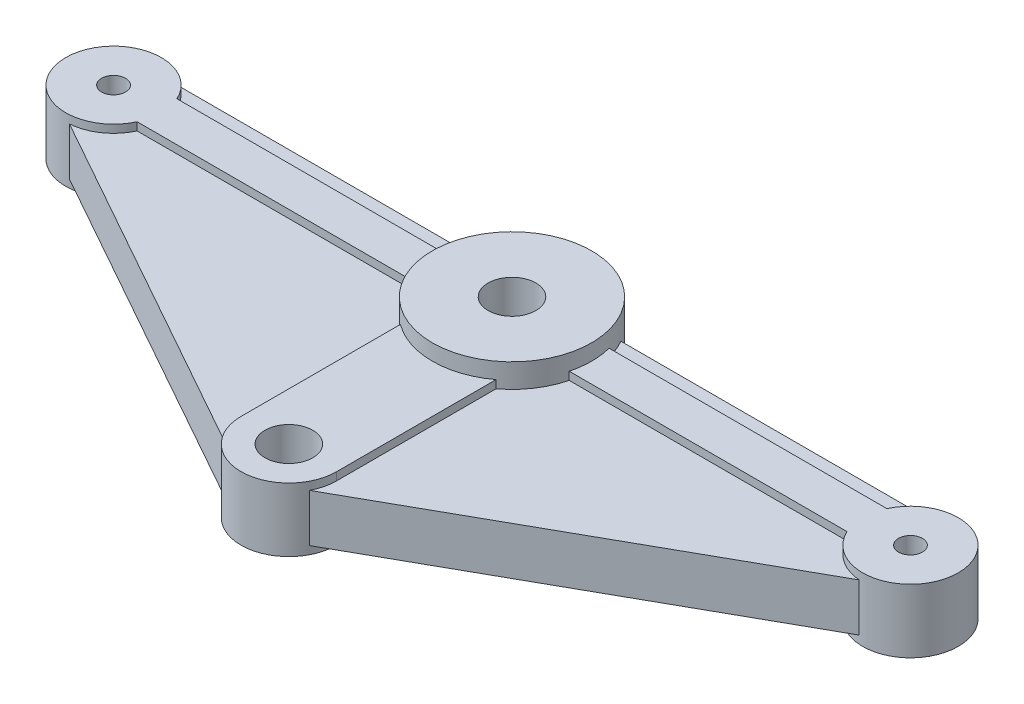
from build123d import *
from build123d.topology import SkipClean

# Parameters (mm, degrees)
SKETCH1_R      = 0.75
SKETCH1_R_2    = 1.5
EXTRUDE1_DEPTH = 1.5
SKETCH2_R      = 0.75
SKETCH2_R_2    = 1.5
EXTRUDE2_DEPTH = 2
SKETCH3_R      = 5
SKETCH3_R_2    = 1.5
EXTRUDE3_DEPTH = 3


with BuildPart() as part:
    # Sketch1 → Extrude1 (new, symmetric)
    with BuildSketch(Plane(origin=(0, 0, 0), x_dir=(1, 0, 0), z_dir=(0, 1, 0))):
        with BuildLine():
            Line((-25, 2.5), (25, 2.5))
            ThreePointArc((25, 2.5), (27.419004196, 0.631204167), (26.221508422, -2.18126504))
            Line((26.221508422, -2.18126504), (1.221508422, -16.18126504))
            ThreePointArc((1.221508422, -16.18126504), (0, -16.5), (-1.221508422, -16.18126504))
            Line((-1.221508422, -16.18126504), (-26.221508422, -2.18126504))
            ThreePointArc((-26.221508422, -2.18126504), (-27.419004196, 0.631204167), (-25, 2.5))
        make_face()
        with Locations(Location((25, 0, 0), (0, 0, 270))):
            Circle(SKETCH1_R, mode=Mode.SUBTRACT)
        with Locations(Location((-25, 0, 0), (0, 0, 270))):
            Circle(SKETCH1_R, mode=Mode.SUBTRACT)
        with Locations(Location((0, -14, 0), (0, 0, 270))):
            Circle(SKETCH1_R_2, mode=Mode.SUBTRACT)
        with Locations(Location((0, 0, 0), (0, 0, 270))):
            Circle(SKETCH1_R_2, mode=Mode.SUBTRACT)
    extrude(amount=EXTRUDE1_DEPTH, both=True)

    # Sketch2 → Extrude2 (add, symmetric)
    with SkipClean():  # the faces are left unmerged after this step: merging them gives an invalid solid
        with BuildSketch(Plane(origin=(0, 0, 0), x_dir=(1, 0, 0), z_dir=(0, 1, 0))):
            with BuildLine():
                Line((-22.272821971, 1.25), (-0.829156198, 1.25))
                ThreePointArc((-0.829156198, 1.25), (0, -1.5), (0.829156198, 1.25))
                Line((0.829156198, 1.25), (22.272821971, 1.25))
                ThreePointArc((22.272821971, 1.25), (28, 0), (22.272821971, -1.25))
                Line((22.272821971, -1.25), (3, -1.25))
                Line((3, -1.25), (3, -14))
                ThreePointArc((3, -14), (0, -17), (-3, -14))
                Line((-3, -14), (-3, -1.25))
                Line((-3, -1.25), (-22.272821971, -1.25))
                ThreePointArc((-22.272821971, -1.25), (-28, 0), (-22.272821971, 1.25))
            make_face()
            with Locations(Location((25, 0, 0), (0, 0, 270))):
                Circle(SKETCH2_R, mode=Mode.SUBTRACT)
            with Locations(Location((0, -14, 0), (0, 0, 270))):
                Circle(SKETCH2_R_2, mode=Mode.SUBTRACT)
            with Locations(Location((-25, 0, 0), (0, 0, 270))):
                Circle(SKETCH2_R, mode=Mode.SUBTRACT)
        extrude(amount=EXTRUDE2_DEPTH, both=True)

    # Sketch3 → Extrude3 (add, symmetric)
    with SkipClean():  # the faces are left unmerged after this step: merging them gives an invalid solid
        with BuildSketch(Plane(origin=(0, 0, 0), x_dir=(1, 0, 0), z_dir=(0, 1, 0))):
            with Locations(Location((0, 0, 0), (0, 0, 270))):
                Circle(SKETCH3_R)
            with Locations(Location((0, 0, 0), (0, 0, 270))):
                Circle(SKETCH3_R_2, mode=Mode.SUBTRACT)
        extrude(amount=EXTRUDE3_DEPTH, both=True)


solid = part.part
